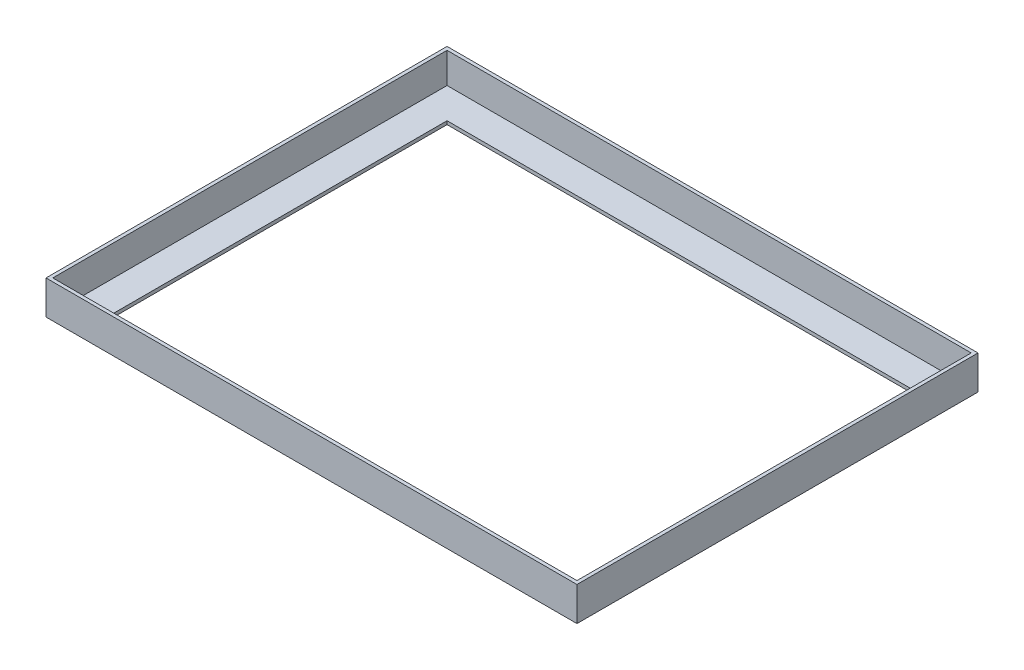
ISO-10303-21;
HEADER;
FILE_DESCRIPTION(('STEP AP214'),'2;1');
FILE_NAME('part.step','',(''),(''),'','','');
FILE_SCHEMA(('AUTOMOTIVE_DESIGN { 1 0 10303 214 1 1 1 1 }'));
ENDSEC;
DATA;
#1=APPLICATION_CONTEXT('core data for automotive mechanical design processes');
#2=APPLICATION_PROTOCOL_DEFINITION('international standard','automotive_design',2000,#1);
#3=PRODUCT_CONTEXT('',#1,'mechanical');
#4=PRODUCT('Part','Part','',(#3));
#5=PRODUCT_RELATED_PRODUCT_CATEGORY('part','',(#4));
#6=PRODUCT_DEFINITION_FORMATION('','',#4);
#7=PRODUCT_DEFINITION_CONTEXT('part definition',#1,'design');
#8=PRODUCT_DEFINITION('design','',#6,#7);
#9=PRODUCT_DEFINITION_SHAPE('','',#8);
#10=(LENGTH_UNIT() NAMED_UNIT(*) SI_UNIT(.MILLI.,.METRE.));
#11=(NAMED_UNIT(*) PLANE_ANGLE_UNIT() SI_UNIT($,.RADIAN.));
#12=(NAMED_UNIT(*) SI_UNIT($,.STERADIAN.) SOLID_ANGLE_UNIT());
#13=UNCERTAINTY_MEASURE_WITH_UNIT(LENGTH_MEASURE(1.E-05),#10,'distance_accuracy_value','');
#14=(GEOMETRIC_REPRESENTATION_CONTEXT(3) GLOBAL_UNCERTAINTY_ASSIGNED_CONTEXT((#13)) GLOBAL_UNIT_ASSIGNED_CONTEXT((#10,
#11,#12)) REPRESENTATION_CONTEXT('',''));
#15=CARTESIAN_POINT('',(0.,0.,0.));
#16=DIRECTION('',(0.,0.,1.));
#17=DIRECTION('',(1.,0.,0.));
#18=AXIS2_PLACEMENT_3D('',#15,#16,#17);
#19=CARTESIAN_POINT('',(0.,3.,0.));
#20=DIRECTION('',(0.,1.,0.));
#21=DIRECTION('',(0.,0.,1.));
#22=AXIS2_PLACEMENT_3D('',#19,#20,#21);
#23=PLANE('',#22);
#24=DIRECTION('',(0.,0.,1.));
#25=VECTOR('',#24,1.);
#26=CARTESIAN_POINT('',(-232.,3.,-174.5));
#27=LINE('',#26,#25);
#28=CARTESIAN_POINT('',(-232.,3.,-174.5));
#29=VERTEX_POINT('',#28);
#30=CARTESIAN_POINT('',(-232.,3.,174.5));
#31=VERTEX_POINT('',#30);
#32=EDGE_CURVE('E55',#29,#31,#27,.T.);
#33=ORIENTED_EDGE('',*,*,#32,.T.);
#34=DIRECTION('',(1.,0.,0.));
#35=VECTOR('',#34,1.);
#36=CARTESIAN_POINT('',(-232.,3.,174.5));
#37=LINE('',#36,#35);
#38=CARTESIAN_POINT('',(232.,3.,174.5));
#39=VERTEX_POINT('',#38);
#40=EDGE_CURVE('E59',#31,#39,#37,.T.);
#41=ORIENTED_EDGE('',*,*,#40,.T.);
#42=DIRECTION('',(0.,0.,-1.));
#43=VECTOR('',#42,1.);
#44=CARTESIAN_POINT('',(232.,3.,174.5));
#45=LINE('',#44,#43);
#46=CARTESIAN_POINT('',(232.,3.,-174.5));
#47=VERTEX_POINT('',#46);
#48=EDGE_CURVE('E164',#39,#47,#45,.T.);
#49=ORIENTED_EDGE('',*,*,#48,.T.);
#50=DIRECTION('',(-1.,0.,0.));
#51=VECTOR('',#50,1.);
#52=CARTESIAN_POINT('',(232.,3.,-174.5));
#53=LINE('',#52,#51);
#54=EDGE_CURVE('E139',#47,#29,#53,.T.);
#55=ORIENTED_EDGE('',*,*,#54,.T.);
#56=EDGE_LOOP('',(#33,#41,#49,#55));
#57=FACE_BOUND('',#56,.T.);
#58=DIRECTION('',(0.,0.,1.));
#59=VECTOR('',#58,1.);
#60=CARTESIAN_POINT('',(-205.,3.,-147.5));
#61=LINE('',#60,#59);
#62=CARTESIAN_POINT('',(-205.,3.,-147.5));
#63=VERTEX_POINT('',#62);
#64=CARTESIAN_POINT('',(-205.,3.,147.5));
#65=VERTEX_POINT('',#64);
#66=EDGE_CURVE('E196',#63,#65,#61,.T.);
#67=ORIENTED_EDGE('',*,*,#66,.F.);
#68=DIRECTION('',(-1.,0.,0.));
#69=VECTOR('',#68,1.);
#70=CARTESIAN_POINT('',(-205.,3.,-147.5));
#71=LINE('',#70,#69);
#72=CARTESIAN_POINT('',(205.,3.,-147.5));
#73=VERTEX_POINT('',#72);
#74=EDGE_CURVE('E193',#73,#63,#71,.T.);
#75=ORIENTED_EDGE('',*,*,#74,.F.);
#76=DIRECTION('',(0.,0.,-1.));
#77=VECTOR('',#76,1.);
#78=CARTESIAN_POINT('',(205.,3.,-147.5));
#79=LINE('',#78,#77);
#80=CARTESIAN_POINT('',(205.,3.,147.5));
#81=VERTEX_POINT('',#80);
#82=EDGE_CURVE('E204',#81,#73,#79,.T.);
#83=ORIENTED_EDGE('',*,*,#82,.F.);
#84=DIRECTION('',(1.,0.,0.));
#85=VECTOR('',#84,1.);
#86=CARTESIAN_POINT('',(-205.,3.,147.5));
#87=LINE('',#86,#85);
#88=EDGE_CURVE('E200',#65,#81,#87,.T.);
#89=ORIENTED_EDGE('',*,*,#88,.F.);
#90=EDGE_LOOP('',(#67,#75,#83,#89));
#91=FACE_BOUND('',#90,.T.);
#92=ADVANCED_FACE('F39',(#57,#91),#23,.T.);
#93=CARTESIAN_POINT('',(0.,0.,0.));
#94=DIRECTION('',(0.,1.,0.));
#95=DIRECTION('',(0.,0.,1.));
#96=AXIS2_PLACEMENT_3D('',#93,#94,#95);
#97=PLANE('',#96);
#98=DIRECTION('',(0.,0.,-1.));
#99=VECTOR('',#98,1.);
#100=CARTESIAN_POINT('',(235.,0.,-177.5));
#101=LINE('',#100,#99);
#102=CARTESIAN_POINT('',(235.,0.,177.5));
#103=VERTEX_POINT('',#102);
#104=CARTESIAN_POINT('',(235.,0.,-177.5));
#105=VERTEX_POINT('',#104);
#106=EDGE_CURVE('E235',#103,#105,#101,.T.);
#107=ORIENTED_EDGE('',*,*,#106,.F.);
#108=DIRECTION('',(1.,0.,0.));
#109=VECTOR('',#108,1.);
#110=CARTESIAN_POINT('',(-235.,0.,177.5));
#111=LINE('',#110,#109);
#112=CARTESIAN_POINT('',(-235.,0.,177.5));
#113=VERTEX_POINT('',#112);
#114=EDGE_CURVE('E245',#113,#103,#111,.T.);
#115=ORIENTED_EDGE('',*,*,#114,.F.);
#116=DIRECTION('',(0.,0.,1.));
#117=VECTOR('',#116,1.);
#118=CARTESIAN_POINT('',(-235.,0.,-177.5));
#119=LINE('',#118,#117);
#120=CARTESIAN_POINT('',(-235.,0.,-177.5));
#121=VERTEX_POINT('',#120);
#122=EDGE_CURVE('E242',#121,#113,#119,.T.);
#123=ORIENTED_EDGE('',*,*,#122,.F.);
#124=DIRECTION('',(-1.,0.,0.));
#125=VECTOR('',#124,1.);
#126=CARTESIAN_POINT('',(-235.,0.,-177.5));
#127=LINE('',#126,#125);
#128=EDGE_CURVE('E239',#105,#121,#127,.T.);
#129=ORIENTED_EDGE('',*,*,#128,.F.);
#130=EDGE_LOOP('',(#107,#115,#123,#129));
#131=FACE_BOUND('',#130,.T.);
#132=DIRECTION('',(-1.,0.,0.));
#133=VECTOR('',#132,1.);
#134=CARTESIAN_POINT('',(-205.,0.,-147.5));
#135=LINE('',#134,#133);
#136=CARTESIAN_POINT('',(205.,0.,-147.5));
#137=VERTEX_POINT('',#136);
#138=CARTESIAN_POINT('',(-205.,0.,-147.5));
#139=VERTEX_POINT('',#138);
#140=EDGE_CURVE('E192',#137,#139,#135,.T.);
#141=ORIENTED_EDGE('',*,*,#140,.T.);
#142=DIRECTION('',(0.,0.,1.));
#143=VECTOR('',#142,1.);
#144=CARTESIAN_POINT('',(-205.,0.,-147.5));
#145=LINE('',#144,#143);
#146=CARTESIAN_POINT('',(-205.,0.,147.5));
#147=VERTEX_POINT('',#146);
#148=EDGE_CURVE('E211',#139,#147,#145,.T.);
#149=ORIENTED_EDGE('',*,*,#148,.T.);
#150=DIRECTION('',(1.,0.,0.));
#151=VECTOR('',#150,1.);
#152=CARTESIAN_POINT('',(-205.,0.,147.5));
#153=LINE('',#152,#151);
#154=CARTESIAN_POINT('',(205.,0.,147.5));
#155=VERTEX_POINT('',#154);
#156=EDGE_CURVE('E215',#147,#155,#153,.T.);
#157=ORIENTED_EDGE('',*,*,#156,.T.);
#158=DIRECTION('',(0.,0.,-1.));
#159=VECTOR('',#158,1.);
#160=CARTESIAN_POINT('',(205.,0.,-147.5));
#161=LINE('',#160,#159);
#162=EDGE_CURVE('E197',#155,#137,#161,.T.);
#163=ORIENTED_EDGE('',*,*,#162,.T.);
#164=EDGE_LOOP('',(#141,#149,#157,#163));
#165=FACE_BOUND('',#164,.T.);
#166=ADVANCED_FACE('F266',(#131,#165),#97,.F.);
#167=CARTESIAN_POINT('',(235.,3.,-177.5));
#168=DIRECTION('',(-1.,0.,0.));
#169=DIRECTION('',(0.,0.,1.));
#170=AXIS2_PLACEMENT_3D('',#167,#168,#169);
#171=PLANE('',#170);
#172=ORIENTED_EDGE('',*,*,#106,.T.);
#173=DIRECTION('',(0.,-1.,0.));
#174=VECTOR('',#173,1.);
#175=CARTESIAN_POINT('',(235.,3.,-177.5));
#176=LINE('',#175,#174);
#177=CARTESIAN_POINT('',(235.,30.,-177.5));
#178=VERTEX_POINT('',#177);
#179=EDGE_CURVE('E11',#178,#105,#176,.T.);
#180=ORIENTED_EDGE('',*,*,#179,.F.);
#181=DIRECTION('',(0.,0.,-1.));
#182=VECTOR('',#181,1.);
#183=CARTESIAN_POINT('',(235.,30.,177.5));
#184=LINE('',#183,#182);
#185=CARTESIAN_POINT('',(235.,30.,177.5));
#186=VERTEX_POINT('',#185);
#187=EDGE_CURVE('E184',#186,#178,#184,.T.);
#188=ORIENTED_EDGE('',*,*,#187,.F.);
#189=DIRECTION('',(0.,-1.,0.));
#190=VECTOR('',#189,1.);
#191=CARTESIAN_POINT('',(235.,3.,177.5));
#192=LINE('',#191,#190);
#193=EDGE_CURVE('E248',#186,#103,#192,.T.);
#194=ORIENTED_EDGE('',*,*,#193,.T.);
#195=EDGE_LOOP('',(#172,#180,#188,#194));
#196=FACE_BOUND('',#195,.T.);
#197=ADVANCED_FACE('F41',(#196),#171,.F.);
#198=CARTESIAN_POINT('',(-235.,3.,-177.5));
#199=DIRECTION('',(0.,0.,1.));
#200=DIRECTION('',(1.,0.,0.));
#201=AXIS2_PLACEMENT_3D('',#198,#199,#200);
#202=PLANE('',#201);
#203=ORIENTED_EDGE('',*,*,#128,.T.);
#204=DIRECTION('',(0.,-1.,0.));
#205=VECTOR('',#204,1.);
#206=CARTESIAN_POINT('',(-235.,3.,-177.5));
#207=LINE('',#206,#205);
#208=CARTESIAN_POINT('',(-235.,30.,-177.5));
#209=VERTEX_POINT('',#208);
#210=EDGE_CURVE('E48',#209,#121,#207,.T.);
#211=ORIENTED_EDGE('',*,*,#210,.F.);
#212=DIRECTION('',(-1.,0.,0.));
#213=VECTOR('',#212,1.);
#214=CARTESIAN_POINT('',(235.,30.,-177.5));
#215=LINE('',#214,#213);
#216=EDGE_CURVE('E188',#178,#209,#215,.T.);
#217=ORIENTED_EDGE('',*,*,#216,.F.);
#218=ORIENTED_EDGE('',*,*,#179,.T.);
#219=EDGE_LOOP('',(#203,#211,#217,#218));
#220=FACE_BOUND('',#219,.T.);
#221=ADVANCED_FACE('F274',(#220),#202,.F.);
#222=CARTESIAN_POINT('',(-235.,3.,-177.5));
#223=DIRECTION('',(1.,0.,0.));
#224=DIRECTION('',(0.,0.,-1.));
#225=AXIS2_PLACEMENT_3D('',#222,#223,#224);
#226=PLANE('',#225);
#227=ORIENTED_EDGE('',*,*,#122,.T.);
#228=DIRECTION('',(0.,-1.,0.));
#229=VECTOR('',#228,1.);
#230=CARTESIAN_POINT('',(-235.,3.,177.5));
#231=LINE('',#230,#229);
#232=CARTESIAN_POINT('',(-235.,30.,177.5));
#233=VERTEX_POINT('',#232);
#234=EDGE_CURVE('E252',#233,#113,#231,.T.);
#235=ORIENTED_EDGE('',*,*,#234,.F.);
#236=DIRECTION('',(0.,0.,1.));
#237=VECTOR('',#236,1.);
#238=CARTESIAN_POINT('',(-235.,30.,-177.5));
#239=LINE('',#238,#237);
#240=EDGE_CURVE('E145',#209,#233,#239,.T.);
#241=ORIENTED_EDGE('',*,*,#240,.F.);
#242=ORIENTED_EDGE('',*,*,#210,.T.);
#243=EDGE_LOOP('',(#227,#235,#241,#242));
#244=FACE_BOUND('',#243,.T.);
#245=ADVANCED_FACE('F260',(#244),#226,.F.);
#246=CARTESIAN_POINT('',(-235.,3.,177.5));
#247=DIRECTION('',(0.,0.,-1.));
#248=DIRECTION('',(-1.,0.,0.));
#249=AXIS2_PLACEMENT_3D('',#246,#247,#248);
#250=PLANE('',#249);
#251=ORIENTED_EDGE('',*,*,#114,.T.);
#252=ORIENTED_EDGE('',*,*,#193,.F.);
#253=DIRECTION('',(1.,0.,0.));
#254=VECTOR('',#253,1.);
#255=CARTESIAN_POINT('',(-235.,30.,177.5));
#256=LINE('',#255,#254);
#257=EDGE_CURVE('E180',#233,#186,#256,.T.);
#258=ORIENTED_EDGE('',*,*,#257,.F.);
#259=ORIENTED_EDGE('',*,*,#234,.T.);
#260=EDGE_LOOP('',(#251,#252,#258,#259));
#261=FACE_BOUND('',#260,.T.);
#262=ADVANCED_FACE('F269',(#261),#250,.F.);
#263=CARTESIAN_POINT('',(-205.,3.,-147.5));
#264=DIRECTION('',(0.,0.,1.));
#265=DIRECTION('',(1.,0.,0.));
#266=AXIS2_PLACEMENT_3D('',#263,#264,#265);
#267=PLANE('',#266);
#268=ORIENTED_EDGE('',*,*,#140,.F.);
#269=DIRECTION('',(0.,-1.,0.));
#270=VECTOR('',#269,1.);
#271=CARTESIAN_POINT('',(205.,3.,-147.5));
#272=LINE('',#271,#270);
#273=EDGE_CURVE('E207',#73,#137,#272,.T.);
#274=ORIENTED_EDGE('',*,*,#273,.F.);
#275=ORIENTED_EDGE('',*,*,#74,.T.);
#276=DIRECTION('',(0.,-1.,0.));
#277=VECTOR('',#276,1.);
#278=CARTESIAN_POINT('',(-205.,3.,-147.5));
#279=LINE('',#278,#277);
#280=EDGE_CURVE('E231',#63,#139,#279,.T.);
#281=ORIENTED_EDGE('',*,*,#280,.T.);
#282=EDGE_LOOP('',(#268,#274,#275,#281));
#283=FACE_BOUND('',#282,.T.);
#284=ADVANCED_FACE('F289',(#283),#267,.T.);
#285=CARTESIAN_POINT('',(-205.,3.,-147.5));
#286=DIRECTION('',(1.,0.,0.));
#287=DIRECTION('',(0.,0.,-1.));
#288=AXIS2_PLACEMENT_3D('',#285,#286,#287);
#289=PLANE('',#288);
#290=ORIENTED_EDGE('',*,*,#148,.F.);
#291=ORIENTED_EDGE('',*,*,#280,.F.);
#292=ORIENTED_EDGE('',*,*,#66,.T.);
#293=DIRECTION('',(0.,-1.,0.));
#294=VECTOR('',#293,1.);
#295=CARTESIAN_POINT('',(-205.,3.,147.5));
#296=LINE('',#295,#294);
#297=EDGE_CURVE('E228',#65,#147,#296,.T.);
#298=ORIENTED_EDGE('',*,*,#297,.T.);
#299=EDGE_LOOP('',(#290,#291,#292,#298));
#300=FACE_BOUND('',#299,.T.);
#301=ADVANCED_FACE('F296',(#300),#289,.T.);
#302=CARTESIAN_POINT('',(-205.,3.,147.5));
#303=DIRECTION('',(0.,0.,-1.));
#304=DIRECTION('',(-1.,0.,0.));
#305=AXIS2_PLACEMENT_3D('',#302,#303,#304);
#306=PLANE('',#305);
#307=ORIENTED_EDGE('',*,*,#156,.F.);
#308=ORIENTED_EDGE('',*,*,#297,.F.);
#309=ORIENTED_EDGE('',*,*,#88,.T.);
#310=DIRECTION('',(0.,-1.,0.));
#311=VECTOR('',#310,1.);
#312=CARTESIAN_POINT('',(205.,3.,147.5));
#313=LINE('',#312,#311);
#314=EDGE_CURVE('E225',#81,#155,#313,.T.);
#315=ORIENTED_EDGE('',*,*,#314,.T.);
#316=EDGE_LOOP('',(#307,#308,#309,#315));
#317=FACE_BOUND('',#316,.T.);
#318=ADVANCED_FACE('F301',(#317),#306,.T.);
#319=CARTESIAN_POINT('',(205.,3.,-147.5));
#320=DIRECTION('',(-1.,0.,0.));
#321=DIRECTION('',(0.,0.,1.));
#322=AXIS2_PLACEMENT_3D('',#319,#320,#321);
#323=PLANE('',#322);
#324=ORIENTED_EDGE('',*,*,#162,.F.);
#325=ORIENTED_EDGE('',*,*,#314,.F.);
#326=ORIENTED_EDGE('',*,*,#82,.T.);
#327=ORIENTED_EDGE('',*,*,#273,.T.);
#328=EDGE_LOOP('',(#324,#325,#326,#327));
#329=FACE_BOUND('',#328,.T.);
#330=ADVANCED_FACE('F308',(#329),#323,.T.);
#331=CARTESIAN_POINT('',(0.,30.,0.));
#332=DIRECTION('',(0.,1.,0.));
#333=DIRECTION('',(0.,0.,1.));
#334=AXIS2_PLACEMENT_3D('',#331,#332,#333);
#335=PLANE('',#334);
#336=ORIENTED_EDGE('',*,*,#240,.T.);
#337=ORIENTED_EDGE('',*,*,#257,.T.);
#338=ORIENTED_EDGE('',*,*,#187,.T.);
#339=ORIENTED_EDGE('',*,*,#216,.T.);
#340=EDGE_LOOP('',(#336,#337,#338,#339));
#341=FACE_BOUND('',#340,.T.);
#342=DIRECTION('',(1.,0.,0.));
#343=VECTOR('',#342,1.);
#344=CARTESIAN_POINT('',(-232.,30.,174.5));
#345=LINE('',#344,#343);
#346=CARTESIAN_POINT('',(-232.,30.,174.5));
#347=VERTEX_POINT('',#346);
#348=CARTESIAN_POINT('',(232.,30.,174.5));
#349=VERTEX_POINT('',#348);
#350=EDGE_CURVE('E138',#347,#349,#345,.T.);
#351=ORIENTED_EDGE('',*,*,#350,.F.);
#352=DIRECTION('',(0.,0.,1.));
#353=VECTOR('',#352,1.);
#354=CARTESIAN_POINT('',(-232.,30.,-174.5));
#355=LINE('',#354,#353);
#356=CARTESIAN_POINT('',(-232.,30.,-174.5));
#357=VERTEX_POINT('',#356);
#358=EDGE_CURVE('E128',#357,#347,#355,.T.);
#359=ORIENTED_EDGE('',*,*,#358,.F.);
#360=DIRECTION('',(-1.,0.,0.));
#361=VECTOR('',#360,1.);
#362=CARTESIAN_POINT('',(232.,30.,-174.5));
#363=LINE('',#362,#361);
#364=CARTESIAN_POINT('',(232.,30.,-174.5));
#365=VERTEX_POINT('',#364);
#366=EDGE_CURVE('E155',#365,#357,#363,.T.);
#367=ORIENTED_EDGE('',*,*,#366,.F.);
#368=DIRECTION('',(0.,0.,-1.));
#369=VECTOR('',#368,1.);
#370=CARTESIAN_POINT('',(232.,30.,174.5));
#371=LINE('',#370,#369);
#372=EDGE_CURVE('E151',#349,#365,#371,.T.);
#373=ORIENTED_EDGE('',*,*,#372,.F.);
#374=EDGE_LOOP('',(#351,#359,#367,#373));
#375=FACE_BOUND('',#374,.T.);
#376=ADVANCED_FACE('F149',(#341,#375),#335,.T.);
#377=CARTESIAN_POINT('',(-232.,30.,-174.5));
#378=DIRECTION('',(1.,0.,0.));
#379=DIRECTION('',(0.,0.,-1.));
#380=AXIS2_PLACEMENT_3D('',#377,#378,#379);
#381=PLANE('',#380);
#382=ORIENTED_EDGE('',*,*,#32,.F.);
#383=DIRECTION('',(0.,-1.,0.));
#384=VECTOR('',#383,1.);
#385=CARTESIAN_POINT('',(-232.,30.,-174.5));
#386=LINE('',#385,#384);
#387=EDGE_CURVE('E133',#357,#29,#386,.T.);
#388=ORIENTED_EDGE('',*,*,#387,.F.);
#389=ORIENTED_EDGE('',*,*,#358,.T.);
#390=DIRECTION('',(0.,-1.,0.));
#391=VECTOR('',#390,1.);
#392=CARTESIAN_POINT('',(-232.,30.,174.5));
#393=LINE('',#392,#391);
#394=EDGE_CURVE('E131',#347,#31,#393,.T.);
#395=ORIENTED_EDGE('',*,*,#394,.T.);
#396=EDGE_LOOP('',(#382,#388,#389,#395));
#397=FACE_BOUND('',#396,.T.);
#398=ADVANCED_FACE('F130',(#397),#381,.T.);
#399=CARTESIAN_POINT('',(-232.,30.,174.5));
#400=DIRECTION('',(0.,0.,-1.));
#401=DIRECTION('',(-1.,0.,0.));
#402=AXIS2_PLACEMENT_3D('',#399,#400,#401);
#403=PLANE('',#402);
#404=ORIENTED_EDGE('',*,*,#40,.F.);
#405=ORIENTED_EDGE('',*,*,#394,.F.);
#406=ORIENTED_EDGE('',*,*,#350,.T.);
#407=DIRECTION('',(0.,-1.,0.));
#408=VECTOR('',#407,1.);
#409=CARTESIAN_POINT('',(232.,30.,174.5));
#410=LINE('',#409,#408);
#411=EDGE_CURVE('E146',#349,#39,#410,.T.);
#412=ORIENTED_EDGE('',*,*,#411,.T.);
#413=EDGE_LOOP('',(#404,#405,#406,#412));
#414=FACE_BOUND('',#413,.T.);
#415=ADVANCED_FACE('F142',(#414),#403,.T.);
#416=CARTESIAN_POINT('',(232.,30.,174.5));
#417=DIRECTION('',(-1.,0.,0.));
#418=DIRECTION('',(0.,0.,1.));
#419=AXIS2_PLACEMENT_3D('',#416,#417,#418);
#420=PLANE('',#419);
#421=ORIENTED_EDGE('',*,*,#48,.F.);
#422=ORIENTED_EDGE('',*,*,#411,.F.);
#423=ORIENTED_EDGE('',*,*,#372,.T.);
#424=DIRECTION('',(0.,-1.,0.));
#425=VECTOR('',#424,1.);
#426=CARTESIAN_POINT('',(232.,30.,-174.5));
#427=LINE('',#426,#425);
#428=EDGE_CURVE('E171',#365,#47,#427,.T.);
#429=ORIENTED_EDGE('',*,*,#428,.T.);
#430=EDGE_LOOP('',(#421,#422,#423,#429));
#431=FACE_BOUND('',#430,.T.);
#432=ADVANCED_FACE('F328',(#431),#420,.T.);
#433=CARTESIAN_POINT('',(232.,30.,-174.5));
#434=DIRECTION('',(0.,0.,1.));
#435=DIRECTION('',(1.,0.,0.));
#436=AXIS2_PLACEMENT_3D('',#433,#434,#435);
#437=PLANE('',#436);
#438=ORIENTED_EDGE('',*,*,#54,.F.);
#439=ORIENTED_EDGE('',*,*,#428,.F.);
#440=ORIENTED_EDGE('',*,*,#366,.T.);
#441=ORIENTED_EDGE('',*,*,#387,.T.);
#442=EDGE_LOOP('',(#438,#439,#440,#441));
#443=FACE_BOUND('',#442,.T.);
#444=ADVANCED_FACE('F331',(#443),#437,.T.);
#445=CLOSED_SHELL('',(#92,#166,#197,#221,#245,#262,#284,#301,#318,#330,#376,#398,#415,#432,#444));
#446=MANIFOLD_SOLID_BREP('B2',#445);
#447=ADVANCED_BREP_SHAPE_REPRESENTATION('',(#18,#446),#14);
#448=SHAPE_DEFINITION_REPRESENTATION(#9,#447);
ENDSEC;
END-ISO-10303-21;
